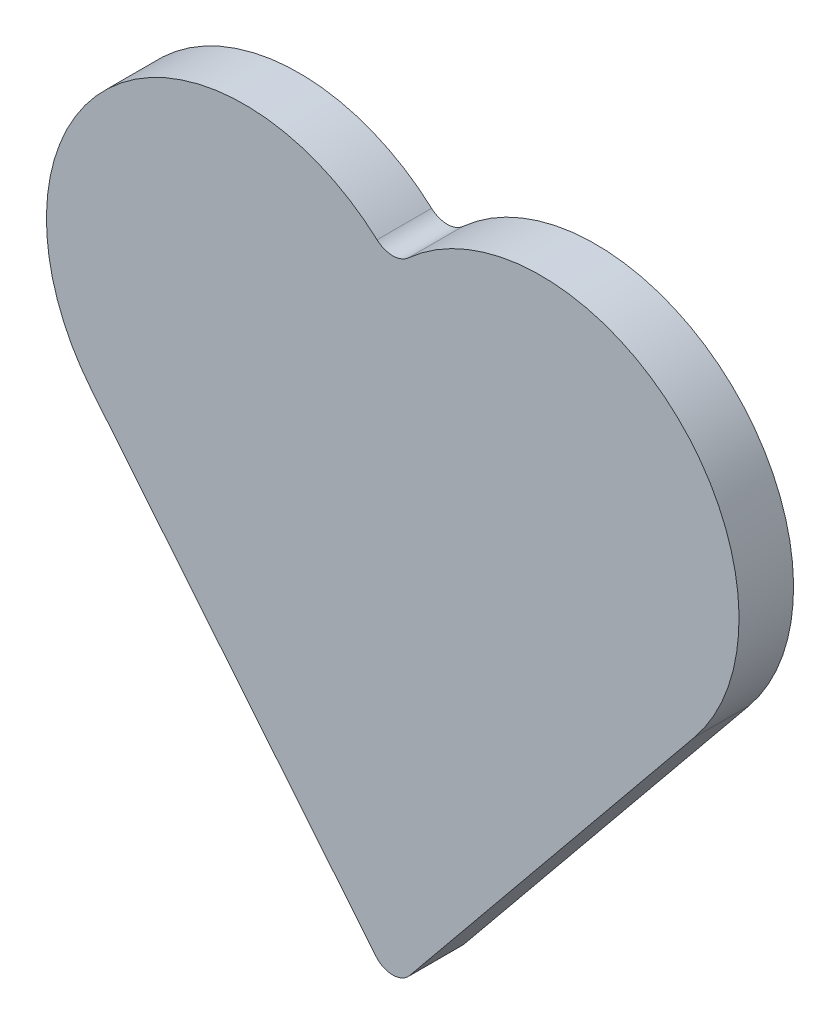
ISO-10303-21;
HEADER;
FILE_DESCRIPTION(('STEP AP214'),'2;1');
FILE_NAME('part.step','',(''),(''),'','','');
FILE_SCHEMA(('AUTOMOTIVE_DESIGN { 1 0 10303 214 1 1 1 1 }'));
ENDSEC;
DATA;
#1=APPLICATION_CONTEXT('core data for automotive mechanical design processes');
#2=APPLICATION_PROTOCOL_DEFINITION('international standard','automotive_design',2000,#1);
#3=PRODUCT_CONTEXT('',#1,'mechanical');
#4=PRODUCT('Part','Part','',(#3));
#5=PRODUCT_RELATED_PRODUCT_CATEGORY('part','',(#4));
#6=PRODUCT_DEFINITION_FORMATION('','',#4);
#7=PRODUCT_DEFINITION_CONTEXT('part definition',#1,'design');
#8=PRODUCT_DEFINITION('design','',#6,#7);
#9=PRODUCT_DEFINITION_SHAPE('','',#8);
#10=(LENGTH_UNIT() NAMED_UNIT(*) SI_UNIT(.MILLI.,.METRE.));
#11=(NAMED_UNIT(*) PLANE_ANGLE_UNIT() SI_UNIT($,.RADIAN.));
#12=(NAMED_UNIT(*) SI_UNIT($,.STERADIAN.) SOLID_ANGLE_UNIT());
#13=UNCERTAINTY_MEASURE_WITH_UNIT(LENGTH_MEASURE(1.E-05),#10,'distance_accuracy_value','');
#14=(GEOMETRIC_REPRESENTATION_CONTEXT(3) GLOBAL_UNCERTAINTY_ASSIGNED_CONTEXT((#13)) GLOBAL_UNIT_ASSIGNED_CONTEXT((#10,
#11,#12)) REPRESENTATION_CONTEXT('',''));
#15=CARTESIAN_POINT('',(0.,0.,0.));
#16=DIRECTION('',(0.,0.,1.));
#17=DIRECTION('',(1.,0.,0.));
#18=AXIS2_PLACEMENT_3D('',#15,#16,#17);
#19=CARTESIAN_POINT('',(4.44325397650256,-3.62888838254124,1.));
#20=DIRECTION('',(-0.774512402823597,0.632558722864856,0.));
#21=DIRECTION('',(-0.632558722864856,-0.774512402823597,0.));
#22=AXIS2_PLACEMENT_3D('',#19,#20,#21);
#23=PLANE('',#22);
#24=DIRECTION('',(0.632558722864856,0.774512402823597,0.));
#25=VECTOR('',#24,1.);
#26=CARTESIAN_POINT('',(4.44325397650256,-3.62888838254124,1.));
#27=LINE('',#26,#25);
#28=CARTESIAN_POINT('',(0.309804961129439,-8.68993238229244,1.));
#29=VERTEX_POINT('',#28);
#30=CARTESIAN_POINT('',(5.53131344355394,-2.29665546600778,1.));
#31=VERTEX_POINT('',#30);
#32=EDGE_CURVE('E87',#29,#31,#27,.T.);
#33=ORIENTED_EDGE('',*,*,#32,.F.);
#34=DIRECTION('',(0.,0.,-1.));
#35=VECTOR('',#34,1.);
#36=CARTESIAN_POINT('',(0.309804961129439,-8.68993238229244,1.));
#37=LINE('',#36,#35);
#38=CARTESIAN_POINT('',(0.309804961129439,-8.68993238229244,0.));
#39=VERTEX_POINT('',#38);
#40=EDGE_CURVE('E111',#29,#39,#37,.T.);
#41=ORIENTED_EDGE('',*,*,#40,.T.);
#42=DIRECTION('',(0.632558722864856,0.774512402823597,0.));
#43=VECTOR('',#42,1.);
#44=CARTESIAN_POINT('',(4.44325397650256,-3.62888838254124,0.));
#45=LINE('',#44,#43);
#46=CARTESIAN_POINT('',(5.53131344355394,-2.29665546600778,0.));
#47=VERTEX_POINT('',#46);
#48=EDGE_CURVE('E109',#39,#47,#45,.T.);
#49=ORIENTED_EDGE('',*,*,#48,.T.);
#50=DIRECTION('',(0.,0.,-1.));
#51=VECTOR('',#50,1.);
#52=CARTESIAN_POINT('',(5.53131344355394,-2.29665546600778,1.));
#53=LINE('',#52,#51);
#54=EDGE_CURVE('E104',#31,#47,#53,.T.);
#55=ORIENTED_EDGE('',*,*,#54,.F.);
#56=EDGE_LOOP('',(#33,#41,#49,#55));
#57=FACE_BOUND('',#56,.T.);
#58=ADVANCED_FACE('F35',(#57),#23,.F.);
#59=CARTESIAN_POINT('',(2.71926125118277,0.,1.));
#60=DIRECTION('',(0.,0.,-1.));
#61=DIRECTION('',(-1.,0.,0.));
#62=AXIS2_PLACEMENT_3D('',#59,#60,#61);
#63=CYLINDRICAL_SURFACE('',#62,3.63073874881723);
#64=CARTESIAN_POINT('',(2.71926125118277,0.,0.));
#65=DIRECTION('',(0.,0.,1.));
#66=DIRECTION('',(1.,0.,0.));
#67=AXIS2_PLACEMENT_3D('',#64,#65,#66);
#68=CIRCLE('',#67,3.63073874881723);
#69=CARTESIAN_POINT('',(0.287165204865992,2.69576940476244,0.));
#70=VERTEX_POINT('',#69);
#71=EDGE_CURVE('E129',#47,#70,#68,.T.);
#72=ORIENTED_EDGE('',*,*,#71,.T.);
#73=DIRECTION('',(0.,0.,-1.));
#74=VECTOR('',#73,1.);
#75=CARTESIAN_POINT('',(0.287165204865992,2.69576940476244,1.));
#76=LINE('',#75,#74);
#77=CARTESIAN_POINT('',(0.287165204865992,2.69576940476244,1.));
#78=VERTEX_POINT('',#77);
#79=EDGE_CURVE('E105',#78,#70,#76,.T.);
#80=ORIENTED_EDGE('',*,*,#79,.F.);
#81=CARTESIAN_POINT('',(2.71926125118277,0.,1.));
#82=DIRECTION('',(0.,0.,1.));
#83=DIRECTION('',(1.,0.,0.));
#84=AXIS2_PLACEMENT_3D('',#81,#82,#83);
#85=CIRCLE('',#84,3.63073874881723);
#86=EDGE_CURVE('E91',#31,#78,#85,.T.);
#87=ORIENTED_EDGE('',*,*,#86,.F.);
#88=ORIENTED_EDGE('',*,*,#54,.T.);
#89=EDGE_LOOP('',(#72,#80,#87,#88));
#90=FACE_BOUND('',#89,.T.);
#91=ADVANCED_FACE('F103',(#90),#63,.T.);
#92=CARTESIAN_POINT('',(0.,3.01406734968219,1.));
#93=DIRECTION('',(0.,0.,-1.));
#94=DIRECTION('',(-1.,0.,0.));
#95=AXIS2_PLACEMENT_3D('',#92,#93,#94);
#96=CYLINDRICAL_SURFACE('',#95,0.428692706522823);
#97=CARTESIAN_POINT('',(0.,3.01406734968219,0.));
#98=DIRECTION('',(0.,0.,1.));
#99=DIRECTION('',(1.,0.,0.));
#100=AXIS2_PLACEMENT_3D('',#97,#98,#99);
#101=CIRCLE('',#100,0.428692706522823);
#102=CARTESIAN_POINT('',(-0.287165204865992,2.69576940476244,0.));
#103=VERTEX_POINT('',#102);
#104=EDGE_CURVE('E126',#103,#70,#101,.T.);
#105=ORIENTED_EDGE('',*,*,#104,.F.);
#106=DIRECTION('',(0.,0.,-1.));
#107=VECTOR('',#106,1.);
#108=CARTESIAN_POINT('',(-0.287165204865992,2.69576940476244,1.));
#109=LINE('',#108,#107);
#110=CARTESIAN_POINT('',(-0.287165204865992,2.69576940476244,1.));
#111=VERTEX_POINT('',#110);
#112=EDGE_CURVE('E114',#111,#103,#109,.T.);
#113=ORIENTED_EDGE('',*,*,#112,.F.);
#114=CARTESIAN_POINT('',(0.,3.01406734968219,1.));
#115=DIRECTION('',(0.,0.,1.));
#116=DIRECTION('',(1.,0.,0.));
#117=AXIS2_PLACEMENT_3D('',#114,#115,#116);
#118=CIRCLE('',#117,0.428692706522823);
#119=EDGE_CURVE('E107',#111,#78,#118,.T.);
#120=ORIENTED_EDGE('',*,*,#119,.T.);
#121=ORIENTED_EDGE('',*,*,#79,.T.);
#122=EDGE_LOOP('',(#105,#113,#120,#121));
#123=FACE_BOUND('',#122,.T.);
#124=ADVANCED_FACE('F137',(#123),#96,.F.);
#125=CARTESIAN_POINT('',(-2.71926125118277,0.,1.));
#126=DIRECTION('',(0.,0.,-1.));
#127=DIRECTION('',(-1.,0.,0.));
#128=AXIS2_PLACEMENT_3D('',#125,#126,#127);
#129=CYLINDRICAL_SURFACE('',#128,3.63073874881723);
#130=CARTESIAN_POINT('',(-2.71926125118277,0.,0.));
#131=DIRECTION('',(0.,0.,1.));
#132=DIRECTION('',(1.,0.,0.));
#133=AXIS2_PLACEMENT_3D('',#130,#131,#132);
#134=CIRCLE('',#133,3.63073874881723);
#135=CARTESIAN_POINT('',(-5.53131344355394,-2.29665546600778,0.));
#136=VERTEX_POINT('',#135);
#137=EDGE_CURVE('E124',#103,#136,#134,.T.);
#138=ORIENTED_EDGE('',*,*,#137,.T.);
#139=DIRECTION('',(0.,0.,-1.));
#140=VECTOR('',#139,1.);
#141=CARTESIAN_POINT('',(-5.53131344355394,-2.29665546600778,1.));
#142=LINE('',#141,#140);
#143=CARTESIAN_POINT('',(-5.53131344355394,-2.29665546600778,1.));
#144=VERTEX_POINT('',#143);
#145=EDGE_CURVE('E119',#144,#136,#142,.T.);
#146=ORIENTED_EDGE('',*,*,#145,.F.);
#147=CARTESIAN_POINT('',(-2.71926125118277,0.,1.));
#148=DIRECTION('',(0.,0.,1.));
#149=DIRECTION('',(1.,0.,0.));
#150=AXIS2_PLACEMENT_3D('',#147,#148,#149);
#151=CIRCLE('',#150,3.63073874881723);
#152=EDGE_CURVE('E133',#111,#144,#151,.T.);
#153=ORIENTED_EDGE('',*,*,#152,.F.);
#154=ORIENTED_EDGE('',*,*,#112,.T.);
#155=EDGE_LOOP('',(#138,#146,#153,#154));
#156=FACE_BOUND('',#155,.T.);
#157=ADVANCED_FACE('F141',(#156),#129,.T.);
#158=CARTESIAN_POINT('',(-4.44325397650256,-3.62888838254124,1.));
#159=DIRECTION('',(0.774512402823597,0.632558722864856,0.));
#160=DIRECTION('',(-0.632558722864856,0.774512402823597,0.));
#161=AXIS2_PLACEMENT_3D('',#158,#159,#160);
#162=PLANE('',#161);
#163=DIRECTION('',(0.632558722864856,-0.774512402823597,0.));
#164=VECTOR('',#163,1.);
#165=CARTESIAN_POINT('',(-4.44325397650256,-3.62888838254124,0.));
#166=LINE('',#165,#164);
#167=CARTESIAN_POINT('',(-0.309804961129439,-8.68993238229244,0.));
#168=VERTEX_POINT('',#167);
#169=EDGE_CURVE('E98',#136,#168,#166,.T.);
#170=ORIENTED_EDGE('',*,*,#169,.T.);
#171=DIRECTION('',(0.,0.,-1.));
#172=VECTOR('',#171,1.);
#173=CARTESIAN_POINT('',(-0.309804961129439,-8.68993238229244,1.));
#174=LINE('',#173,#172);
#175=CARTESIAN_POINT('',(-0.309804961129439,-8.68993238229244,1.));
#176=VERTEX_POINT('',#175);
#177=EDGE_CURVE('E43',#168,#176,#174,.F.);
#178=ORIENTED_EDGE('',*,*,#177,.T.);
#179=DIRECTION('',(0.632558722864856,-0.774512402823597,0.));
#180=VECTOR('',#179,1.);
#181=CARTESIAN_POINT('',(-4.44325397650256,-3.62888838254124,1.));
#182=LINE('',#181,#180);
#183=EDGE_CURVE('E122',#144,#176,#182,.T.);
#184=ORIENTED_EDGE('',*,*,#183,.F.);
#185=ORIENTED_EDGE('',*,*,#145,.T.);
#186=EDGE_LOOP('',(#170,#178,#184,#185));
#187=FACE_BOUND('',#186,.T.);
#188=ADVANCED_FACE('F143',(#187),#162,.F.);
#189=CARTESIAN_POINT('',(0.,0.,1.));
#190=DIRECTION('',(0.,0.,1.));
#191=DIRECTION('',(1.,0.,0.));
#192=AXIS2_PLACEMENT_3D('',#189,#190,#191);
#193=PLANE('',#192);
#194=ORIENTED_EDGE('',*,*,#183,.T.);
#195=CARTESIAN_POINT('',(0.,-8.4369088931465,1.));
#196=DIRECTION('',(0.,0.,1.));
#197=DIRECTION('',(1.,0.,0.));
#198=AXIS2_PLACEMENT_3D('',#195,#196,#197);
#199=CIRCLE('',#198,0.4);
#200=EDGE_CURVE('E11',#176,#29,#199,.T.);
#201=ORIENTED_EDGE('',*,*,#200,.T.);
#202=ORIENTED_EDGE('',*,*,#32,.T.);
#203=ORIENTED_EDGE('',*,*,#86,.T.);
#204=ORIENTED_EDGE('',*,*,#119,.F.);
#205=ORIENTED_EDGE('',*,*,#152,.T.);
#206=EDGE_LOOP('',(#194,#201,#202,#203,#204,#205));
#207=FACE_BOUND('',#206,.T.);
#208=ADVANCED_FACE('F89',(#207),#193,.T.);
#209=CARTESIAN_POINT('',(0.,0.,0.));
#210=DIRECTION('',(0.,0.,1.));
#211=DIRECTION('',(1.,0.,0.));
#212=AXIS2_PLACEMENT_3D('',#209,#210,#211);
#213=PLANE('',#212);
#214=ORIENTED_EDGE('',*,*,#48,.F.);
#215=CARTESIAN_POINT('',(0.,-8.4369088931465,0.));
#216=DIRECTION('',(0.,0.,1.));
#217=DIRECTION('',(1.,0.,0.));
#218=AXIS2_PLACEMENT_3D('',#215,#216,#217);
#219=CIRCLE('',#218,0.4);
#220=EDGE_CURVE('E57',#39,#168,#219,.F.);
#221=ORIENTED_EDGE('',*,*,#220,.T.);
#222=ORIENTED_EDGE('',*,*,#169,.F.);
#223=ORIENTED_EDGE('',*,*,#137,.F.);
#224=ORIENTED_EDGE('',*,*,#104,.T.);
#225=ORIENTED_EDGE('',*,*,#71,.F.);
#226=EDGE_LOOP('',(#214,#221,#222,#223,#224,#225));
#227=FACE_BOUND('',#226,.T.);
#228=ADVANCED_FACE('F150',(#227),#213,.F.);
#229=CARTESIAN_POINT('',(0.,-8.4369088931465,1.));
#230=DIRECTION('',(0.,0.,-1.));
#231=DIRECTION('',(-1.,0.,0.));
#232=AXIS2_PLACEMENT_3D('',#229,#230,#231);
#233=CYLINDRICAL_SURFACE('',#232,0.4);
#234=ORIENTED_EDGE('',*,*,#200,.F.);
#235=ORIENTED_EDGE('',*,*,#177,.F.);
#236=ORIENTED_EDGE('',*,*,#220,.F.);
#237=ORIENTED_EDGE('',*,*,#40,.F.);
#238=EDGE_LOOP('',(#234,#235,#236,#237));
#239=FACE_BOUND('',#238,.T.);
#240=ADVANCED_FACE('F37',(#239),#233,.T.);
#241=CLOSED_SHELL('',(#58,#91,#124,#157,#188,#208,#228,#240));
#242=MANIFOLD_SOLID_BREP('B2',#241);
#243=ADVANCED_BREP_SHAPE_REPRESENTATION('',(#18,#242),#14);
#244=SHAPE_DEFINITION_REPRESENTATION(#9,#243);
ENDSEC;
END-ISO-10303-21;
